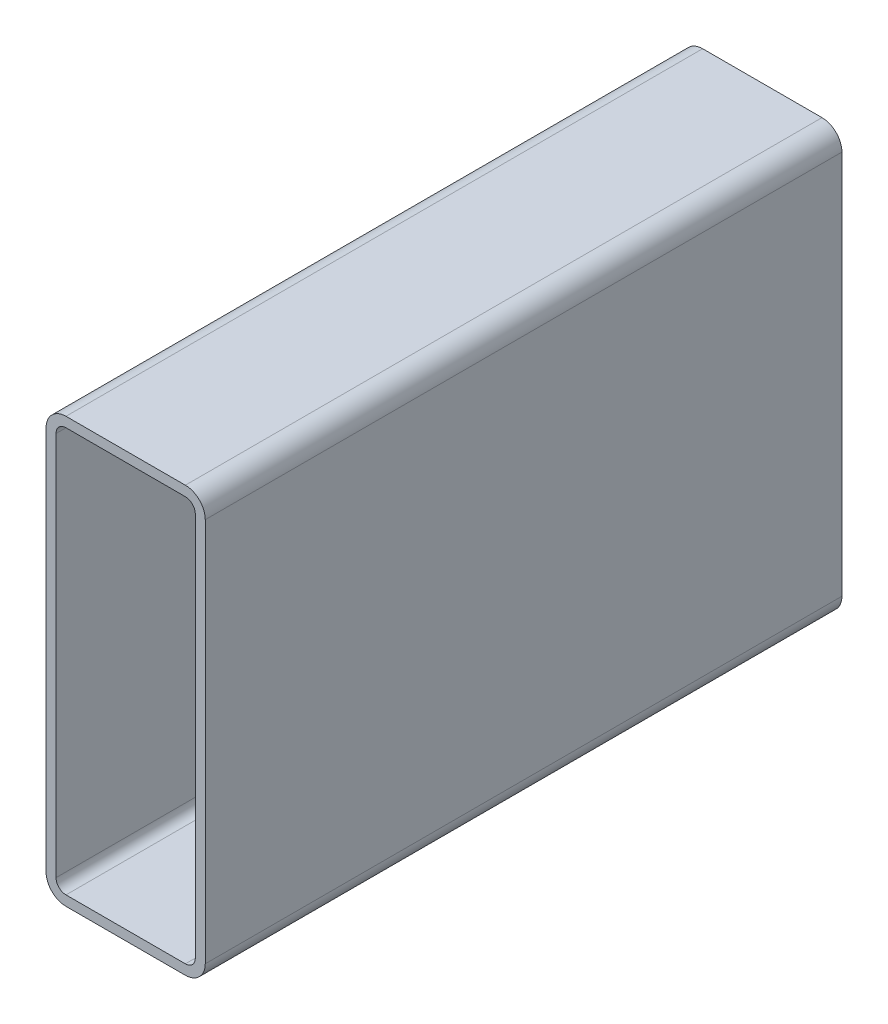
ISO-10303-21;
HEADER;
FILE_DESCRIPTION(('STEP AP214'),'2;1');
FILE_NAME('part.step','',(''),(''),'','','');
FILE_SCHEMA(('AUTOMOTIVE_DESIGN { 1 0 10303 214 1 1 1 1 }'));
ENDSEC;
DATA;
#1=APPLICATION_CONTEXT('core data for automotive mechanical design processes');
#2=APPLICATION_PROTOCOL_DEFINITION('international standard','automotive_design',2000,#1);
#3=PRODUCT_CONTEXT('',#1,'mechanical');
#4=PRODUCT('Part','Part','',(#3));
#5=PRODUCT_RELATED_PRODUCT_CATEGORY('part','',(#4));
#6=PRODUCT_DEFINITION_FORMATION('','',#4);
#7=PRODUCT_DEFINITION_CONTEXT('part definition',#1,'design');
#8=PRODUCT_DEFINITION('design','',#6,#7);
#9=PRODUCT_DEFINITION_SHAPE('','',#8);
#10=(LENGTH_UNIT() NAMED_UNIT(*) SI_UNIT(.MILLI.,.METRE.));
#11=(NAMED_UNIT(*) PLANE_ANGLE_UNIT() SI_UNIT($,.RADIAN.));
#12=(NAMED_UNIT(*) SI_UNIT($,.STERADIAN.) SOLID_ANGLE_UNIT());
#13=UNCERTAINTY_MEASURE_WITH_UNIT(LENGTH_MEASURE(1.E-05),#10,'distance_accuracy_value','');
#14=(GEOMETRIC_REPRESENTATION_CONTEXT(3) GLOBAL_UNCERTAINTY_ASSIGNED_CONTEXT((#13)) GLOBAL_UNIT_ASSIGNED_CONTEXT((#10,
#11,#12)) REPRESENTATION_CONTEXT('',''));
#15=CARTESIAN_POINT('',(0.,0.,0.));
#16=DIRECTION('',(0.,0.,1.));
#17=DIRECTION('',(1.,0.,0.));
#18=AXIS2_PLACEMENT_3D('',#15,#16,#17);
#19=CARTESIAN_POINT('',(12.0141160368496,195.641130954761,304.8));
#20=DIRECTION('',(0.,0.,1.));
#21=DIRECTION('',(1.,0.,0.));
#22=AXIS2_PLACEMENT_3D('',#19,#20,#21);
#23=PLANE('',#22);
#24=CARTESIAN_POINT('',(12.0141160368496,195.641130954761,304.8));
#25=DIRECTION('',(0.,0.,1.));
#26=DIRECTION('',(1.,0.,0.));
#27=AXIS2_PLACEMENT_3D('',#24,#25,#26);
#28=CIRCLE('',#27,9.52500000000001);
#29=CARTESIAN_POINT('',(12.0141160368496,205.166130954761,304.8));
#30=VERTEX_POINT('',#29);
#31=CARTESIAN_POINT('',(2.48911603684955,195.641130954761,304.8));
#32=VERTEX_POINT('',#31);
#33=EDGE_CURVE('E211',#30,#32,#28,.T.);
#34=ORIENTED_EDGE('',*,*,#33,.T.);
#35=DIRECTION('',(0.,-1.,0.));
#36=VECTOR('',#35,1.);
#37=CARTESIAN_POINT('',(2.48911603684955,11.4911309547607,304.8));
#38=LINE('',#37,#36);
#39=CARTESIAN_POINT('',(2.48911603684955,11.4911309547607,304.8));
#40=VERTEX_POINT('',#39);
#41=EDGE_CURVE('E214',#32,#40,#38,.T.);
#42=ORIENTED_EDGE('',*,*,#41,.T.);
#43=CARTESIAN_POINT('',(12.0141160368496,11.4911309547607,304.8));
#44=DIRECTION('',(0.,0.,1.));
#45=DIRECTION('',(1.,0.,0.));
#46=AXIS2_PLACEMENT_3D('',#43,#44,#45);
#47=CIRCLE('',#46,9.525);
#48=CARTESIAN_POINT('',(12.0141160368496,1.96613095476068,304.8));
#49=VERTEX_POINT('',#48);
#50=EDGE_CURVE('E217',#40,#49,#47,.T.);
#51=ORIENTED_EDGE('',*,*,#50,.T.);
#52=DIRECTION('',(1.,0.,0.));
#53=VECTOR('',#52,1.);
#54=CARTESIAN_POINT('',(69.1641160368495,1.96613095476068,304.8));
#55=LINE('',#54,#53);
#56=CARTESIAN_POINT('',(69.1641160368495,1.96613095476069,304.8));
#57=VERTEX_POINT('',#56);
#58=EDGE_CURVE('E219',#49,#57,#55,.T.);
#59=ORIENTED_EDGE('',*,*,#58,.T.);
#60=CARTESIAN_POINT('',(69.1641160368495,11.4911309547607,304.8));
#61=DIRECTION('',(0.,0.,1.));
#62=DIRECTION('',(1.,0.,0.));
#63=AXIS2_PLACEMENT_3D('',#60,#61,#62);
#64=CIRCLE('',#63,9.525);
#65=CARTESIAN_POINT('',(78.6891160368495,11.4911309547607,304.8));
#66=VERTEX_POINT('',#65);
#67=EDGE_CURVE('E221',#57,#66,#64,.T.);
#68=ORIENTED_EDGE('',*,*,#67,.T.);
#69=DIRECTION('',(0.,1.,0.));
#70=VECTOR('',#69,1.);
#71=CARTESIAN_POINT('',(78.6891160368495,195.641130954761,304.8));
#72=LINE('',#71,#70);
#73=CARTESIAN_POINT('',(78.6891160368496,195.641130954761,304.8));
#74=VERTEX_POINT('',#73);
#75=EDGE_CURVE('E223',#66,#74,#72,.T.);
#76=ORIENTED_EDGE('',*,*,#75,.T.);
#77=CARTESIAN_POINT('',(69.1641160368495,195.641130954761,304.8));
#78=DIRECTION('',(0.,0.,1.));
#79=DIRECTION('',(1.,0.,0.));
#80=AXIS2_PLACEMENT_3D('',#77,#78,#79);
#81=CIRCLE('',#80,9.525);
#82=CARTESIAN_POINT('',(69.1641160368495,205.166130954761,304.8));
#83=VERTEX_POINT('',#82);
#84=EDGE_CURVE('E225',#74,#83,#81,.T.);
#85=ORIENTED_EDGE('',*,*,#84,.T.);
#86=DIRECTION('',(-1.,0.,0.));
#87=VECTOR('',#86,1.);
#88=CARTESIAN_POINT('',(12.0141160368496,205.166130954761,304.8));
#89=LINE('',#88,#87);
#90=EDGE_CURVE('E227',#83,#30,#89,.T.);
#91=ORIENTED_EDGE('',*,*,#90,.T.);
#92=EDGE_LOOP('',(#34,#42,#51,#59,#68,#76,#85,#91));
#93=FACE_BOUND('',#92,.T.);
#94=DIRECTION('',(0.,-1.,0.));
#95=VECTOR('',#94,1.);
#96=CARTESIAN_POINT('',(7.25161603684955,11.4911309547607,304.8));
#97=LINE('',#96,#95);
#98=CARTESIAN_POINT('',(7.25161603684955,195.641130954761,304.8));
#99=VERTEX_POINT('',#98);
#100=CARTESIAN_POINT('',(7.25161603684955,11.4911309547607,304.8));
#101=VERTEX_POINT('',#100);
#102=EDGE_CURVE('E154',#99,#101,#97,.T.);
#103=ORIENTED_EDGE('',*,*,#102,.F.);
#104=CARTESIAN_POINT('',(12.0141160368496,195.641130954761,304.8));
#105=DIRECTION('',(0.,0.,1.));
#106=DIRECTION('',(1.,0.,0.));
#107=AXIS2_PLACEMENT_3D('',#104,#105,#106);
#108=CIRCLE('',#107,4.7625);
#109=CARTESIAN_POINT('',(12.0141160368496,200.403630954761,304.8));
#110=VERTEX_POINT('',#109);
#111=EDGE_CURVE('E146',#110,#99,#108,.T.);
#112=ORIENTED_EDGE('',*,*,#111,.F.);
#113=DIRECTION('',(-1.,0.,0.));
#114=VECTOR('',#113,1.);
#115=CARTESIAN_POINT('',(12.0141160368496,200.403630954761,304.8));
#116=LINE('',#115,#114);
#117=CARTESIAN_POINT('',(69.1641160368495,200.403630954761,304.8));
#118=VERTEX_POINT('',#117);
#119=EDGE_CURVE('E179',#118,#110,#116,.T.);
#120=ORIENTED_EDGE('',*,*,#119,.F.);
#121=CARTESIAN_POINT('',(69.1641160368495,195.641130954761,304.8));
#122=DIRECTION('',(0.,0.,1.));
#123=DIRECTION('',(1.,0.,0.));
#124=AXIS2_PLACEMENT_3D('',#121,#122,#123);
#125=CIRCLE('',#124,4.7625);
#126=CARTESIAN_POINT('',(73.9266160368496,195.641130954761,304.8));
#127=VERTEX_POINT('',#126);
#128=EDGE_CURVE('E177',#127,#118,#125,.T.);
#129=ORIENTED_EDGE('',*,*,#128,.F.);
#130=DIRECTION('',(0.,1.,0.));
#131=VECTOR('',#130,1.);
#132=CARTESIAN_POINT('',(73.9266160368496,195.641130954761,304.8));
#133=LINE('',#132,#131);
#134=CARTESIAN_POINT('',(73.9266160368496,11.4911309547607,304.8));
#135=VERTEX_POINT('',#134);
#136=EDGE_CURVE('E175',#135,#127,#133,.T.);
#137=ORIENTED_EDGE('',*,*,#136,.F.);
#138=CARTESIAN_POINT('',(69.1641160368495,11.4911309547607,304.8));
#139=DIRECTION('',(0.,0.,1.));
#140=DIRECTION('',(1.,0.,0.));
#141=AXIS2_PLACEMENT_3D('',#138,#139,#140);
#142=CIRCLE('',#141,4.7625);
#143=CARTESIAN_POINT('',(69.1641160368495,6.72863095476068,304.8));
#144=VERTEX_POINT('',#143);
#145=EDGE_CURVE('E173',#144,#135,#142,.T.);
#146=ORIENTED_EDGE('',*,*,#145,.F.);
#147=DIRECTION('',(1.,0.,0.));
#148=VECTOR('',#147,1.);
#149=CARTESIAN_POINT('',(69.1641160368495,6.72863095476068,304.8));
#150=LINE('',#149,#148);
#151=CARTESIAN_POINT('',(12.0141160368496,6.72863095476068,304.8));
#152=VERTEX_POINT('',#151);
#153=EDGE_CURVE('E169',#152,#144,#150,.T.);
#154=ORIENTED_EDGE('',*,*,#153,.F.);
#155=CARTESIAN_POINT('',(12.0141160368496,11.4911309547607,304.8));
#156=DIRECTION('',(0.,0.,1.));
#157=DIRECTION('',(1.,0.,0.));
#158=AXIS2_PLACEMENT_3D('',#155,#156,#157);
#159=CIRCLE('',#158,4.7625);
#160=EDGE_CURVE('E167',#101,#152,#159,.T.);
#161=ORIENTED_EDGE('',*,*,#160,.F.);
#162=EDGE_LOOP('',(#103,#112,#120,#129,#137,#146,#154,#161));
#163=FACE_BOUND('',#162,.T.);
#164=ADVANCED_FACE('F33',(#93,#163),#23,.T.);
#165=CARTESIAN_POINT('',(12.0141160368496,195.641130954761,0.));
#166=DIRECTION('',(0.,0.,1.));
#167=DIRECTION('',(1.,0.,0.));
#168=AXIS2_PLACEMENT_3D('',#165,#166,#167);
#169=PLANE('',#168);
#170=CARTESIAN_POINT('',(12.0141160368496,195.641130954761,0.));
#171=DIRECTION('',(0.,0.,1.));
#172=DIRECTION('',(1.,0.,0.));
#173=AXIS2_PLACEMENT_3D('',#170,#171,#172);
#174=CIRCLE('',#173,9.52500000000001);
#175=CARTESIAN_POINT('',(12.0141160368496,205.166130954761,0.));
#176=VERTEX_POINT('',#175);
#177=CARTESIAN_POINT('',(2.48911603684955,195.641130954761,0.));
#178=VERTEX_POINT('',#177);
#179=EDGE_CURVE('E162',#176,#178,#174,.T.);
#180=ORIENTED_EDGE('',*,*,#179,.F.);
#181=DIRECTION('',(-1.,0.,0.));
#182=VECTOR('',#181,1.);
#183=CARTESIAN_POINT('',(12.0141160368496,205.166130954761,0.));
#184=LINE('',#183,#182);
#185=CARTESIAN_POINT('',(69.1641160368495,205.166130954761,0.));
#186=VERTEX_POINT('',#185);
#187=EDGE_CURVE('E215',#186,#176,#184,.T.);
#188=ORIENTED_EDGE('',*,*,#187,.F.);
#189=CARTESIAN_POINT('',(69.1641160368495,195.641130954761,0.));
#190=DIRECTION('',(0.,0.,1.));
#191=DIRECTION('',(1.,0.,0.));
#192=AXIS2_PLACEMENT_3D('',#189,#190,#191);
#193=CIRCLE('',#192,9.525);
#194=CARTESIAN_POINT('',(78.6891160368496,195.641130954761,0.));
#195=VERTEX_POINT('',#194);
#196=EDGE_CURVE('E242',#195,#186,#193,.T.);
#197=ORIENTED_EDGE('',*,*,#196,.F.);
#198=DIRECTION('',(0.,1.,0.));
#199=VECTOR('',#198,1.);
#200=CARTESIAN_POINT('',(78.6891160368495,195.641130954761,0.));
#201=LINE('',#200,#199);
#202=CARTESIAN_POINT('',(78.6891160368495,11.4911309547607,0.));
#203=VERTEX_POINT('',#202);
#204=EDGE_CURVE('E240',#203,#195,#201,.T.);
#205=ORIENTED_EDGE('',*,*,#204,.F.);
#206=CARTESIAN_POINT('',(69.1641160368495,11.4911309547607,0.));
#207=DIRECTION('',(0.,0.,1.));
#208=DIRECTION('',(1.,0.,0.));
#209=AXIS2_PLACEMENT_3D('',#206,#207,#208);
#210=CIRCLE('',#209,9.525);
#211=CARTESIAN_POINT('',(69.1641160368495,1.96613095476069,0.));
#212=VERTEX_POINT('',#211);
#213=EDGE_CURVE('E238',#212,#203,#210,.T.);
#214=ORIENTED_EDGE('',*,*,#213,.F.);
#215=DIRECTION('',(1.,0.,0.));
#216=VECTOR('',#215,1.);
#217=CARTESIAN_POINT('',(69.1641160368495,1.96613095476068,0.));
#218=LINE('',#217,#216);
#219=CARTESIAN_POINT('',(12.0141160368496,1.96613095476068,0.));
#220=VERTEX_POINT('',#219);
#221=EDGE_CURVE('E236',#220,#212,#218,.T.);
#222=ORIENTED_EDGE('',*,*,#221,.F.);
#223=CARTESIAN_POINT('',(12.0141160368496,11.4911309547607,0.));
#224=DIRECTION('',(0.,0.,1.));
#225=DIRECTION('',(1.,0.,0.));
#226=AXIS2_PLACEMENT_3D('',#223,#224,#225);
#227=CIRCLE('',#226,9.525);
#228=CARTESIAN_POINT('',(2.48911603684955,11.4911309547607,0.));
#229=VERTEX_POINT('',#228);
#230=EDGE_CURVE('E234',#229,#220,#227,.T.);
#231=ORIENTED_EDGE('',*,*,#230,.F.);
#232=DIRECTION('',(0.,-1.,0.));
#233=VECTOR('',#232,1.);
#234=CARTESIAN_POINT('',(2.48911603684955,11.4911309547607,0.));
#235=LINE('',#234,#233);
#236=EDGE_CURVE('E232',#178,#229,#235,.T.);
#237=ORIENTED_EDGE('',*,*,#236,.F.);
#238=EDGE_LOOP('',(#180,#188,#197,#205,#214,#222,#231,#237));
#239=FACE_BOUND('',#238,.T.);
#240=CARTESIAN_POINT('',(12.0141160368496,195.641130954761,0.));
#241=DIRECTION('',(0.,0.,1.));
#242=DIRECTION('',(1.,0.,0.));
#243=AXIS2_PLACEMENT_3D('',#240,#241,#242);
#244=CIRCLE('',#243,4.7625);
#245=CARTESIAN_POINT('',(12.0141160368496,200.403630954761,0.));
#246=VERTEX_POINT('',#245);
#247=CARTESIAN_POINT('',(7.25161603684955,195.641130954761,0.));
#248=VERTEX_POINT('',#247);
#249=EDGE_CURVE('E56',#246,#248,#244,.T.);
#250=ORIENTED_EDGE('',*,*,#249,.T.);
#251=DIRECTION('',(0.,-1.,0.));
#252=VECTOR('',#251,1.);
#253=CARTESIAN_POINT('',(7.25161603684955,11.4911309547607,0.));
#254=LINE('',#253,#252);
#255=CARTESIAN_POINT('',(7.25161603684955,11.4911309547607,0.));
#256=VERTEX_POINT('',#255);
#257=EDGE_CURVE('E161',#248,#256,#254,.T.);
#258=ORIENTED_EDGE('',*,*,#257,.T.);
#259=CARTESIAN_POINT('',(12.0141160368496,11.4911309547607,0.));
#260=DIRECTION('',(0.,0.,1.));
#261=DIRECTION('',(1.,0.,0.));
#262=AXIS2_PLACEMENT_3D('',#259,#260,#261);
#263=CIRCLE('',#262,4.7625);
#264=CARTESIAN_POINT('',(12.0141160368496,6.72863095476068,0.));
#265=VERTEX_POINT('',#264);
#266=EDGE_CURVE('E183',#256,#265,#263,.T.);
#267=ORIENTED_EDGE('',*,*,#266,.T.);
#268=DIRECTION('',(1.,0.,0.));
#269=VECTOR('',#268,1.);
#270=CARTESIAN_POINT('',(69.1641160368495,6.72863095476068,0.));
#271=LINE('',#270,#269);
#272=CARTESIAN_POINT('',(69.1641160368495,6.72863095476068,0.));
#273=VERTEX_POINT('',#272);
#274=EDGE_CURVE('E186',#265,#273,#271,.T.);
#275=ORIENTED_EDGE('',*,*,#274,.T.);
#276=CARTESIAN_POINT('',(69.1641160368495,11.4911309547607,0.));
#277=DIRECTION('',(0.,0.,1.));
#278=DIRECTION('',(1.,0.,0.));
#279=AXIS2_PLACEMENT_3D('',#276,#277,#278);
#280=CIRCLE('',#279,4.7625);
#281=CARTESIAN_POINT('',(73.9266160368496,11.4911309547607,0.));
#282=VERTEX_POINT('',#281);
#283=EDGE_CURVE('E189',#273,#282,#280,.T.);
#284=ORIENTED_EDGE('',*,*,#283,.T.);
#285=DIRECTION('',(0.,1.,0.));
#286=VECTOR('',#285,1.);
#287=CARTESIAN_POINT('',(73.9266160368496,195.641130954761,0.));
#288=LINE('',#287,#286);
#289=CARTESIAN_POINT('',(73.9266160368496,195.641130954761,0.));
#290=VERTEX_POINT('',#289);
#291=EDGE_CURVE('E192',#282,#290,#288,.T.);
#292=ORIENTED_EDGE('',*,*,#291,.T.);
#293=CARTESIAN_POINT('',(69.1641160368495,195.641130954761,0.));
#294=DIRECTION('',(0.,0.,1.));
#295=DIRECTION('',(1.,0.,0.));
#296=AXIS2_PLACEMENT_3D('',#293,#294,#295);
#297=CIRCLE('',#296,4.7625);
#298=CARTESIAN_POINT('',(69.1641160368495,200.403630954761,0.));
#299=VERTEX_POINT('',#298);
#300=EDGE_CURVE('E195',#290,#299,#297,.T.);
#301=ORIENTED_EDGE('',*,*,#300,.T.);
#302=DIRECTION('',(-1.,0.,0.));
#303=VECTOR('',#302,1.);
#304=CARTESIAN_POINT('',(12.0141160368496,200.403630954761,0.));
#305=LINE('',#304,#303);
#306=EDGE_CURVE('E155',#299,#246,#305,.T.);
#307=ORIENTED_EDGE('',*,*,#306,.T.);
#308=EDGE_LOOP('',(#250,#258,#267,#275,#284,#292,#301,#307));
#309=FACE_BOUND('',#308,.T.);
#310=ADVANCED_FACE('F272',(#239,#309),#169,.F.);
#311=CARTESIAN_POINT('',(12.0141160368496,195.641130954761,304.8));
#312=DIRECTION('',(0.,0.,-1.));
#313=DIRECTION('',(-1.,0.,0.));
#314=AXIS2_PLACEMENT_3D('',#311,#312,#313);
#315=CYLINDRICAL_SURFACE('',#314,9.52500000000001);
#316=ORIENTED_EDGE('',*,*,#179,.T.);
#317=DIRECTION('',(0.,0.,-1.));
#318=VECTOR('',#317,1.);
#319=CARTESIAN_POINT('',(2.48911603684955,195.641130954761,304.8));
#320=LINE('',#319,#318);
#321=EDGE_CURVE('E11',#32,#178,#320,.T.);
#322=ORIENTED_EDGE('',*,*,#321,.F.);
#323=ORIENTED_EDGE('',*,*,#33,.F.);
#324=DIRECTION('',(0.,0.,-1.));
#325=VECTOR('',#324,1.);
#326=CARTESIAN_POINT('',(12.0141160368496,205.166130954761,304.8));
#327=LINE('',#326,#325);
#328=EDGE_CURVE('E229',#30,#176,#327,.T.);
#329=ORIENTED_EDGE('',*,*,#328,.T.);
#330=EDGE_LOOP('',(#316,#322,#323,#329));
#331=FACE_BOUND('',#330,.T.);
#332=ADVANCED_FACE('F35',(#331),#315,.T.);
#333=CARTESIAN_POINT('',(2.48911603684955,11.4911309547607,304.8));
#334=DIRECTION('',(1.,0.,0.));
#335=DIRECTION('',(0.,0.,-1.));
#336=AXIS2_PLACEMENT_3D('',#333,#334,#335);
#337=PLANE('',#336);
#338=ORIENTED_EDGE('',*,*,#236,.T.);
#339=DIRECTION('',(0.,0.,-1.));
#340=VECTOR('',#339,1.);
#341=CARTESIAN_POINT('',(2.48911603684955,11.4911309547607,304.8));
#342=LINE('',#341,#340);
#343=EDGE_CURVE('E41',#40,#229,#342,.T.);
#344=ORIENTED_EDGE('',*,*,#343,.F.);
#345=ORIENTED_EDGE('',*,*,#41,.F.);
#346=ORIENTED_EDGE('',*,*,#321,.T.);
#347=EDGE_LOOP('',(#338,#344,#345,#346));
#348=FACE_BOUND('',#347,.T.);
#349=ADVANCED_FACE('F289',(#348),#337,.F.);
#350=CARTESIAN_POINT('',(12.0141160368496,11.4911309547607,304.8));
#351=DIRECTION('',(0.,0.,-1.));
#352=DIRECTION('',(-1.,0.,0.));
#353=AXIS2_PLACEMENT_3D('',#350,#351,#352);
#354=CYLINDRICAL_SURFACE('',#353,9.525);
#355=ORIENTED_EDGE('',*,*,#230,.T.);
#356=DIRECTION('',(0.,0.,-1.));
#357=VECTOR('',#356,1.);
#358=CARTESIAN_POINT('',(12.0141160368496,1.96613095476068,304.8));
#359=LINE('',#358,#357);
#360=EDGE_CURVE('E259',#49,#220,#359,.T.);
#361=ORIENTED_EDGE('',*,*,#360,.F.);
#362=ORIENTED_EDGE('',*,*,#50,.F.);
#363=ORIENTED_EDGE('',*,*,#343,.T.);
#364=EDGE_LOOP('',(#355,#361,#362,#363));
#365=FACE_BOUND('',#364,.T.);
#366=ADVANCED_FACE('F266',(#365),#354,.T.);
#367=CARTESIAN_POINT('',(69.1641160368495,1.96613095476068,304.8));
#368=DIRECTION('',(0.,1.,0.));
#369=DIRECTION('',(0.,0.,1.));
#370=AXIS2_PLACEMENT_3D('',#367,#368,#369);
#371=PLANE('',#370);
#372=ORIENTED_EDGE('',*,*,#221,.T.);
#373=DIRECTION('',(0.,0.,-1.));
#374=VECTOR('',#373,1.);
#375=CARTESIAN_POINT('',(69.1641160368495,1.96613095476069,304.8));
#376=LINE('',#375,#374);
#377=EDGE_CURVE('E256',#57,#212,#376,.T.);
#378=ORIENTED_EDGE('',*,*,#377,.F.);
#379=ORIENTED_EDGE('',*,*,#58,.F.);
#380=ORIENTED_EDGE('',*,*,#360,.T.);
#381=EDGE_LOOP('',(#372,#378,#379,#380));
#382=FACE_BOUND('',#381,.T.);
#383=ADVANCED_FACE('F278',(#382),#371,.F.);
#384=CARTESIAN_POINT('',(69.1641160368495,11.4911309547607,304.8));
#385=DIRECTION('',(0.,0.,-1.));
#386=DIRECTION('',(-1.,0.,0.));
#387=AXIS2_PLACEMENT_3D('',#384,#385,#386);
#388=CYLINDRICAL_SURFACE('',#387,9.525);
#389=ORIENTED_EDGE('',*,*,#213,.T.);
#390=DIRECTION('',(0.,0.,-1.));
#391=VECTOR('',#390,1.);
#392=CARTESIAN_POINT('',(78.6891160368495,11.4911309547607,304.8));
#393=LINE('',#392,#391);
#394=EDGE_CURVE('E253',#66,#203,#393,.T.);
#395=ORIENTED_EDGE('',*,*,#394,.F.);
#396=ORIENTED_EDGE('',*,*,#67,.F.);
#397=ORIENTED_EDGE('',*,*,#377,.T.);
#398=EDGE_LOOP('',(#389,#395,#396,#397));
#399=FACE_BOUND('',#398,.T.);
#400=ADVANCED_FACE('F282',(#399),#388,.T.);
#401=CARTESIAN_POINT('',(78.6891160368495,195.641130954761,304.8));
#402=DIRECTION('',(-1.,0.,0.));
#403=DIRECTION('',(0.,0.,1.));
#404=AXIS2_PLACEMENT_3D('',#401,#402,#403);
#405=PLANE('',#404);
#406=ORIENTED_EDGE('',*,*,#204,.T.);
#407=DIRECTION('',(0.,0.,-1.));
#408=VECTOR('',#407,1.);
#409=CARTESIAN_POINT('',(78.6891160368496,195.641130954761,304.8));
#410=LINE('',#409,#408);
#411=EDGE_CURVE('E250',#74,#195,#410,.T.);
#412=ORIENTED_EDGE('',*,*,#411,.F.);
#413=ORIENTED_EDGE('',*,*,#75,.F.);
#414=ORIENTED_EDGE('',*,*,#394,.T.);
#415=EDGE_LOOP('',(#406,#412,#413,#414));
#416=FACE_BOUND('',#415,.T.);
#417=ADVANCED_FACE('F302',(#416),#405,.F.);
#418=CARTESIAN_POINT('',(69.1641160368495,195.641130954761,304.8));
#419=DIRECTION('',(0.,0.,-1.));
#420=DIRECTION('',(-1.,0.,0.));
#421=AXIS2_PLACEMENT_3D('',#418,#419,#420);
#422=CYLINDRICAL_SURFACE('',#421,9.525);
#423=ORIENTED_EDGE('',*,*,#196,.T.);
#424=DIRECTION('',(0.,0.,-1.));
#425=VECTOR('',#424,1.);
#426=CARTESIAN_POINT('',(69.1641160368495,205.166130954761,304.8));
#427=LINE('',#426,#425);
#428=EDGE_CURVE('E247',#83,#186,#427,.T.);
#429=ORIENTED_EDGE('',*,*,#428,.F.);
#430=ORIENTED_EDGE('',*,*,#84,.F.);
#431=ORIENTED_EDGE('',*,*,#411,.T.);
#432=EDGE_LOOP('',(#423,#429,#430,#431));
#433=FACE_BOUND('',#432,.T.);
#434=ADVANCED_FACE('F300',(#433),#422,.T.);
#435=CARTESIAN_POINT('',(12.0141160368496,205.166130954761,304.8));
#436=DIRECTION('',(0.,-1.,0.));
#437=DIRECTION('',(0.,0.,-1.));
#438=AXIS2_PLACEMENT_3D('',#435,#436,#437);
#439=PLANE('',#438);
#440=ORIENTED_EDGE('',*,*,#187,.T.);
#441=ORIENTED_EDGE('',*,*,#328,.F.);
#442=ORIENTED_EDGE('',*,*,#90,.F.);
#443=ORIENTED_EDGE('',*,*,#428,.T.);
#444=EDGE_LOOP('',(#440,#441,#442,#443));
#445=FACE_BOUND('',#444,.T.);
#446=ADVANCED_FACE('F295',(#445),#439,.F.);
#447=CARTESIAN_POINT('',(12.0141160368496,195.641130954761,304.8));
#448=DIRECTION('',(0.,0.,-1.));
#449=DIRECTION('',(-1.,0.,0.));
#450=AXIS2_PLACEMENT_3D('',#447,#448,#449);
#451=CYLINDRICAL_SURFACE('',#450,4.7625);
#452=ORIENTED_EDGE('',*,*,#249,.F.);
#453=DIRECTION('',(0.,0.,-1.));
#454=VECTOR('',#453,1.);
#455=CARTESIAN_POINT('',(12.0141160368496,200.403630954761,304.8));
#456=LINE('',#455,#454);
#457=EDGE_CURVE('E150',#110,#246,#456,.T.);
#458=ORIENTED_EDGE('',*,*,#457,.F.);
#459=ORIENTED_EDGE('',*,*,#111,.T.);
#460=DIRECTION('',(0.,0.,-1.));
#461=VECTOR('',#460,1.);
#462=CARTESIAN_POINT('',(7.25161603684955,195.641130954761,304.8));
#463=LINE('',#462,#461);
#464=EDGE_CURVE('E149',#99,#248,#463,.T.);
#465=ORIENTED_EDGE('',*,*,#464,.T.);
#466=EDGE_LOOP('',(#452,#458,#459,#465));
#467=FACE_BOUND('',#466,.T.);
#468=ADVANCED_FACE('F148',(#467),#451,.F.);
#469=CARTESIAN_POINT('',(7.25161603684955,11.4911309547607,304.8));
#470=DIRECTION('',(1.,0.,0.));
#471=DIRECTION('',(0.,0.,-1.));
#472=AXIS2_PLACEMENT_3D('',#469,#470,#471);
#473=PLANE('',#472);
#474=ORIENTED_EDGE('',*,*,#257,.F.);
#475=ORIENTED_EDGE('',*,*,#464,.F.);
#476=ORIENTED_EDGE('',*,*,#102,.T.);
#477=DIRECTION('',(0.,0.,-1.));
#478=VECTOR('',#477,1.);
#479=CARTESIAN_POINT('',(7.25161603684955,11.4911309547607,304.8));
#480=LINE('',#479,#478);
#481=EDGE_CURVE('E163',#101,#256,#480,.T.);
#482=ORIENTED_EDGE('',*,*,#481,.T.);
#483=EDGE_LOOP('',(#474,#475,#476,#482));
#484=FACE_BOUND('',#483,.T.);
#485=ADVANCED_FACE('F158',(#484),#473,.T.);
#486=CARTESIAN_POINT('',(12.0141160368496,11.4911309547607,304.8));
#487=DIRECTION('',(0.,0.,-1.));
#488=DIRECTION('',(-1.,0.,0.));
#489=AXIS2_PLACEMENT_3D('',#486,#487,#488);
#490=CYLINDRICAL_SURFACE('',#489,4.7625);
#491=ORIENTED_EDGE('',*,*,#266,.F.);
#492=ORIENTED_EDGE('',*,*,#481,.F.);
#493=ORIENTED_EDGE('',*,*,#160,.T.);
#494=DIRECTION('',(0.,0.,-1.));
#495=VECTOR('',#494,1.);
#496=CARTESIAN_POINT('',(12.0141160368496,6.72863095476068,304.8));
#497=LINE('',#496,#495);
#498=EDGE_CURVE('E208',#152,#265,#497,.T.);
#499=ORIENTED_EDGE('',*,*,#498,.T.);
#500=EDGE_LOOP('',(#491,#492,#493,#499));
#501=FACE_BOUND('',#500,.T.);
#502=ADVANCED_FACE('F327',(#501),#490,.F.);
#503=CARTESIAN_POINT('',(69.1641160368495,6.72863095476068,304.8));
#504=DIRECTION('',(0.,1.,0.));
#505=DIRECTION('',(0.,0.,1.));
#506=AXIS2_PLACEMENT_3D('',#503,#504,#505);
#507=PLANE('',#506);
#508=ORIENTED_EDGE('',*,*,#274,.F.);
#509=ORIENTED_EDGE('',*,*,#498,.F.);
#510=ORIENTED_EDGE('',*,*,#153,.T.);
#511=DIRECTION('',(0.,0.,-1.));
#512=VECTOR('',#511,1.);
#513=CARTESIAN_POINT('',(69.1641160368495,6.72863095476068,304.8));
#514=LINE('',#513,#512);
#515=EDGE_CURVE('E206',#144,#273,#514,.T.);
#516=ORIENTED_EDGE('',*,*,#515,.T.);
#517=EDGE_LOOP('',(#508,#509,#510,#516));
#518=FACE_BOUND('',#517,.T.);
#519=ADVANCED_FACE('F331',(#518),#507,.T.);
#520=CARTESIAN_POINT('',(69.1641160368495,11.4911309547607,304.8));
#521=DIRECTION('',(0.,0.,-1.));
#522=DIRECTION('',(-1.,0.,0.));
#523=AXIS2_PLACEMENT_3D('',#520,#521,#522);
#524=CYLINDRICAL_SURFACE('',#523,4.7625);
#525=ORIENTED_EDGE('',*,*,#283,.F.);
#526=ORIENTED_EDGE('',*,*,#515,.F.);
#527=ORIENTED_EDGE('',*,*,#145,.T.);
#528=DIRECTION('',(0.,0.,-1.));
#529=VECTOR('',#528,1.);
#530=CARTESIAN_POINT('',(73.9266160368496,11.4911309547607,304.8));
#531=LINE('',#530,#529);
#532=EDGE_CURVE('E204',#135,#282,#531,.T.);
#533=ORIENTED_EDGE('',*,*,#532,.T.);
#534=EDGE_LOOP('',(#525,#526,#527,#533));
#535=FACE_BOUND('',#534,.T.);
#536=ADVANCED_FACE('F337',(#535),#524,.F.);
#537=CARTESIAN_POINT('',(73.9266160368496,195.641130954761,304.8));
#538=DIRECTION('',(-1.,0.,0.));
#539=DIRECTION('',(0.,0.,1.));
#540=AXIS2_PLACEMENT_3D('',#537,#538,#539);
#541=PLANE('',#540);
#542=ORIENTED_EDGE('',*,*,#291,.F.);
#543=ORIENTED_EDGE('',*,*,#532,.F.);
#544=ORIENTED_EDGE('',*,*,#136,.T.);
#545=DIRECTION('',(0.,0.,-1.));
#546=VECTOR('',#545,1.);
#547=CARTESIAN_POINT('',(73.9266160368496,195.641130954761,304.8));
#548=LINE('',#547,#546);
#549=EDGE_CURVE('E202',#127,#290,#548,.T.);
#550=ORIENTED_EDGE('',*,*,#549,.T.);
#551=EDGE_LOOP('',(#542,#543,#544,#550));
#552=FACE_BOUND('',#551,.T.);
#553=ADVANCED_FACE('F341',(#552),#541,.T.);
#554=CARTESIAN_POINT('',(69.1641160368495,195.641130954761,304.8));
#555=DIRECTION('',(0.,0.,-1.));
#556=DIRECTION('',(-1.,0.,0.));
#557=AXIS2_PLACEMENT_3D('',#554,#555,#556);
#558=CYLINDRICAL_SURFACE('',#557,4.7625);
#559=ORIENTED_EDGE('',*,*,#300,.F.);
#560=ORIENTED_EDGE('',*,*,#549,.F.);
#561=ORIENTED_EDGE('',*,*,#128,.T.);
#562=DIRECTION('',(0.,0.,-1.));
#563=VECTOR('',#562,1.);
#564=CARTESIAN_POINT('',(69.1641160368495,200.403630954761,304.8));
#565=LINE('',#564,#563);
#566=EDGE_CURVE('E48',#118,#299,#565,.T.);
#567=ORIENTED_EDGE('',*,*,#566,.T.);
#568=EDGE_LOOP('',(#559,#560,#561,#567));
#569=FACE_BOUND('',#568,.T.);
#570=ADVANCED_FACE('F345',(#569),#558,.F.);
#571=CARTESIAN_POINT('',(12.0141160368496,200.403630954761,304.8));
#572=DIRECTION('',(0.,-1.,0.));
#573=DIRECTION('',(0.,0.,-1.));
#574=AXIS2_PLACEMENT_3D('',#571,#572,#573);
#575=PLANE('',#574);
#576=ORIENTED_EDGE('',*,*,#306,.F.);
#577=ORIENTED_EDGE('',*,*,#566,.F.);
#578=ORIENTED_EDGE('',*,*,#119,.T.);
#579=ORIENTED_EDGE('',*,*,#457,.T.);
#580=EDGE_LOOP('',(#576,#577,#578,#579));
#581=FACE_BOUND('',#580,.T.);
#582=ADVANCED_FACE('F349',(#581),#575,.T.);
#583=CLOSED_SHELL('',(#164,#310,#332,#349,#366,#383,#400,#417,#434,#446,#468,#485,#502,#519,
#536,#553,#570,#582));
#584=MANIFOLD_SOLID_BREP('B2',#583);
#585=ADVANCED_BREP_SHAPE_REPRESENTATION('',(#18,#584),#14);
#586=SHAPE_DEFINITION_REPRESENTATION(#9,#585);
ENDSEC;
END-ISO-10303-21;
